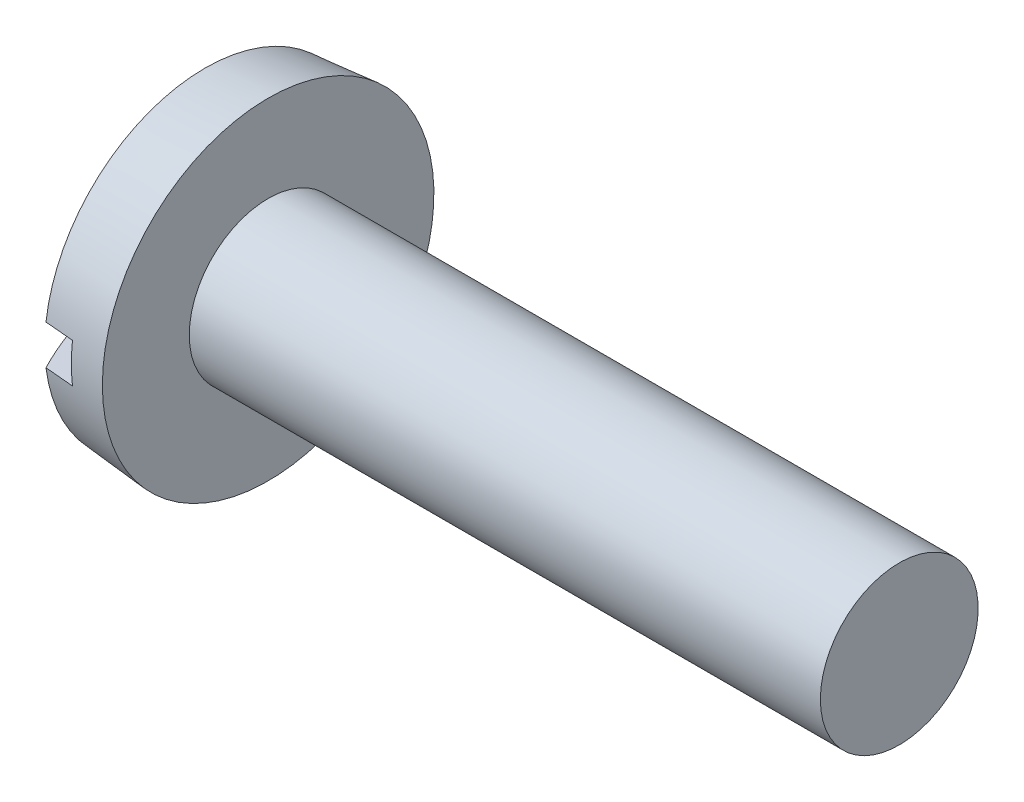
ISO-10303-21;
HEADER;
FILE_DESCRIPTION(('STEP AP214'),'2;1');
FILE_NAME('part.step','',(''),(''),'','','');
FILE_SCHEMA(('AUTOMOTIVE_DESIGN { 1 0 10303 214 1 1 1 1 }'));
ENDSEC;
DATA;
#1=APPLICATION_CONTEXT('core data for automotive mechanical design processes');
#2=APPLICATION_PROTOCOL_DEFINITION('international standard','automotive_design',2000,#1);
#3=PRODUCT_CONTEXT('',#1,'mechanical');
#4=PRODUCT('Part','Part','',(#3));
#5=PRODUCT_RELATED_PRODUCT_CATEGORY('part','',(#4));
#6=PRODUCT_DEFINITION_FORMATION('','',#4);
#7=PRODUCT_DEFINITION_CONTEXT('part definition',#1,'design');
#8=PRODUCT_DEFINITION('design','',#6,#7);
#9=PRODUCT_DEFINITION_SHAPE('','',#8);
#10=(LENGTH_UNIT() NAMED_UNIT(*) SI_UNIT(.MILLI.,.METRE.));
#11=(NAMED_UNIT(*) PLANE_ANGLE_UNIT() SI_UNIT($,.RADIAN.));
#12=(NAMED_UNIT(*) SI_UNIT($,.STERADIAN.) SOLID_ANGLE_UNIT());
#13=UNCERTAINTY_MEASURE_WITH_UNIT(LENGTH_MEASURE(1.E-05),#10,'distance_accuracy_value','');
#14=(GEOMETRIC_REPRESENTATION_CONTEXT(3) GLOBAL_UNCERTAINTY_ASSIGNED_CONTEXT((#13)) GLOBAL_UNIT_ASSIGNED_CONTEXT((#10,
#11,#12)) REPRESENTATION_CONTEXT('',''));
#15=CARTESIAN_POINT('',(0.,0.,0.));
#16=DIRECTION('',(0.,0.,1.));
#17=DIRECTION('',(1.,0.,0.));
#18=AXIS2_PLACEMENT_3D('',#15,#16,#17);
#19=CARTESIAN_POINT('',(4.1402,-1.1938,-10.0076));
#20=DIRECTION('',(1.,0.,0.));
#21=DIRECTION('',(0.,0.,-1.));
#22=AXIS2_PLACEMENT_3D('',#19,#20,#21);
#23=PLANE('',#22);
#24=DIRECTION('',(0.,0.,-1.));
#25=VECTOR('',#24,1.);
#26=CARTESIAN_POINT('',(4.1402,0.735556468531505,-10.0076));
#27=LINE('',#26,#25);
#28=CARTESIAN_POINT('',(4.1402,0.735556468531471,-0.735556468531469));
#29=VERTEX_POINT('',#28);
#30=CARTESIAN_POINT('',(4.1402,0.735556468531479,-2.91484982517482));
#31=VERTEX_POINT('',#30);
#32=EDGE_CURVE('E191',#29,#31,#27,.T.);
#33=ORIENTED_EDGE('',*,*,#32,.F.);
#34=DIRECTION('',(0.,-1.,0.));
#35=VECTOR('',#34,1.);
#36=CARTESIAN_POINT('',(4.1402,-1.1938,-0.735556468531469));
#37=LINE('',#36,#35);
#38=CARTESIAN_POINT('',(4.1402,1.1938,-0.735556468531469));
#39=VERTEX_POINT('',#38);
#40=EDGE_CURVE('E292',#39,#29,#37,.T.);
#41=ORIENTED_EDGE('',*,*,#40,.F.);
#42=DIRECTION('',(0.,0.,1.));
#43=VECTOR('',#42,1.);
#44=CARTESIAN_POINT('',(4.1402,1.1938,-10.0076));
#45=LINE('',#44,#43);
#46=CARTESIAN_POINT('',(4.1402,1.1938,-9.75482339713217));
#47=VERTEX_POINT('',#46);
#48=EDGE_CURVE('E56',#47,#39,#45,.T.);
#49=ORIENTED_EDGE('',*,*,#48,.F.);
#50=CARTESIAN_POINT('',(4.1402,0.,0.));
#51=DIRECTION('',(1.,0.,0.));
#52=DIRECTION('',(0.,0.,-1.));
#53=AXIS2_PLACEMENT_3D('',#50,#51,#52);
#54=CIRCLE('',#53,9.82760082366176);
#55=CARTESIAN_POINT('',(4.1402,-1.1938,-9.75482339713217));
#56=VERTEX_POINT('',#55);
#57=EDGE_CURVE('E245',#56,#47,#54,.T.);
#58=ORIENTED_EDGE('',*,*,#57,.F.);
#59=DIRECTION('',(0.,0.,-1.));
#60=VECTOR('',#59,1.);
#61=CARTESIAN_POINT('',(4.1402,-1.1938,10.0076));
#62=LINE('',#61,#60);
#63=CARTESIAN_POINT('',(4.1402,-1.1938,-0.735556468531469));
#64=VERTEX_POINT('',#63);
#65=EDGE_CURVE('E218',#64,#56,#62,.T.);
#66=ORIENTED_EDGE('',*,*,#65,.F.);
#67=CARTESIAN_POINT('',(4.1402,-0.735556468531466,-0.735556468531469));
#68=VERTEX_POINT('',#67);
#69=EDGE_CURVE('E291',#68,#64,#37,.T.);
#70=ORIENTED_EDGE('',*,*,#69,.F.);
#71=DIRECTION('',(0.,0.,1.));
#72=VECTOR('',#71,1.);
#73=CARTESIAN_POINT('',(4.1402,-0.735556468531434,-10.0076));
#74=LINE('',#73,#72);
#75=CARTESIAN_POINT('',(4.1402,-0.735556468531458,-2.91484982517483));
#76=VERTEX_POINT('',#75);
#77=EDGE_CURVE('E332',#76,#68,#74,.T.);
#78=ORIENTED_EDGE('',*,*,#77,.F.);
#79=DIRECTION('',(0.,1.,0.));
#80=VECTOR('',#79,1.);
#81=CARTESIAN_POINT('',(4.1402,-1.19380000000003,-2.91484982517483));
#82=LINE('',#81,#80);
#83=EDGE_CURVE('E164',#76,#31,#82,.T.);
#84=ORIENTED_EDGE('',*,*,#83,.T.);
#85=EDGE_LOOP('',(#33,#41,#49,#58,#66,#70,#78,#84));
#86=FACE_BOUND('',#85,.T.);
#87=ADVANCED_FACE('F33',(#86),#23,.F.);
#88=DIRECTION('',(0.,0.,-1.));
#89=VECTOR('',#88,1.);
#90=CARTESIAN_POINT('',(4.1402,0.735556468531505,-10.0076));
#91=LINE('',#90,#89);
#92=CARTESIAN_POINT('',(4.1402,0.735556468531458,2.91484982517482));
#93=VERTEX_POINT('',#92);
#94=CARTESIAN_POINT('',(4.1402,0.735556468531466,0.735556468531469));
#95=VERTEX_POINT('',#94);
#96=EDGE_CURVE('E152',#93,#95,#91,.T.);
#97=ORIENTED_EDGE('',*,*,#96,.F.);
#98=DIRECTION('',(0.,-1.,0.));
#99=VECTOR('',#98,1.);
#100=CARTESIAN_POINT('',(4.1402,-1.19380000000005,2.91484982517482));
#101=LINE('',#100,#99);
#102=CARTESIAN_POINT('',(4.1402,-0.735556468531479,2.91484982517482));
#103=VERTEX_POINT('',#102);
#104=EDGE_CURVE('E163',#93,#103,#101,.T.);
#105=ORIENTED_EDGE('',*,*,#104,.T.);
#106=DIRECTION('',(0.,0.,1.));
#107=VECTOR('',#106,1.);
#108=CARTESIAN_POINT('',(4.1402,-0.735556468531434,-10.0076));
#109=LINE('',#108,#107);
#110=CARTESIAN_POINT('',(4.1402,-0.735556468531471,0.735556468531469));
#111=VERTEX_POINT('',#110);
#112=EDGE_CURVE('E340',#111,#103,#109,.T.);
#113=ORIENTED_EDGE('',*,*,#112,.F.);
#114=DIRECTION('',(0.,1.,0.));
#115=VECTOR('',#114,1.);
#116=CARTESIAN_POINT('',(4.1402,-1.1938,0.735556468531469));
#117=LINE('',#116,#115);
#118=CARTESIAN_POINT('',(4.1402,-1.1938,0.735556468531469));
#119=VERTEX_POINT('',#118);
#120=EDGE_CURVE('E289',#119,#111,#117,.T.);
#121=ORIENTED_EDGE('',*,*,#120,.F.);
#122=CARTESIAN_POINT('',(4.1402,-1.1938,9.75482339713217));
#123=VERTEX_POINT('',#122);
#124=EDGE_CURVE('E219',#123,#119,#62,.T.);
#125=ORIENTED_EDGE('',*,*,#124,.F.);
#126=CARTESIAN_POINT('',(4.1402,1.1938,9.75482339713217));
#127=VERTEX_POINT('',#126);
#128=EDGE_CURVE('E249',#127,#123,#54,.T.);
#129=ORIENTED_EDGE('',*,*,#128,.F.);
#130=CARTESIAN_POINT('',(4.1402,1.1938,0.735556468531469));
#131=VERTEX_POINT('',#130);
#132=EDGE_CURVE('E222',#131,#127,#45,.T.);
#133=ORIENTED_EDGE('',*,*,#132,.F.);
#134=EDGE_CURVE('E288',#95,#131,#117,.T.);
#135=ORIENTED_EDGE('',*,*,#134,.F.);
#136=EDGE_LOOP('',(#97,#105,#113,#121,#125,#129,#133,#135));
#137=FACE_BOUND('',#136,.T.);
#138=ADVANCED_FACE('F368',(#137),#23,.F.);
#139=CARTESIAN_POINT('',(7.9338156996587,0.,-0.466952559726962));
#140=DIRECTION('',(-0.0706273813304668,0.,0.997502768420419));
#141=DIRECTION('',(0.99750276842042,0.,0.0706273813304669));
#142=AXIS2_PLACEMENT_3D('',#139,#140,#141);
#143=PLANE('',#142);
#144=ORIENTED_EDGE('',*,*,#40,.T.);
#145=DIRECTION('',(0.995024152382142,-0.0704518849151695,0.0704518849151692));
#146=VECTOR('',#145,1.);
#147=CARTESIAN_POINT('',(7.96654969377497,0.464634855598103,-0.464634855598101));
#148=LINE('',#147,#146);
#149=CARTESIAN_POINT('',(7.2644,0.514350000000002,-0.514349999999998));
#150=VERTEX_POINT('',#149);
#151=EDGE_CURVE('E193',#29,#150,#148,.T.);
#152=ORIENTED_EDGE('',*,*,#151,.T.);
#153=DIRECTION('',(0.791711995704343,-0.608317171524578,0.0560565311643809));
#154=VECTOR('',#153,1.);
#155=CARTESIAN_POINT('',(0.,6.096,-1.0287));
#156=LINE('',#155,#154);
#157=CARTESIAN_POINT('',(0.766265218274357,5.50723502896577,-0.974445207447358));
#158=VERTEX_POINT('',#157);
#159=EDGE_CURVE('E175',#158,#150,#156,.T.);
#160=ORIENTED_EDGE('',*,*,#159,.F.);
#161=CARTESIAN_POINT('',(20.7620372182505,0.,0.44133934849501));
#162=DIRECTION('',(-0.0706273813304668,0.,0.997502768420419));
#163=DIRECTION('',(0.99750276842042,0.,0.0706273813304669));
#164=AXIS2_PLACEMENT_3D('',#161,#162,#163);
#165=CIRCLE('',#164,20.788578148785);
#166=CARTESIAN_POINT('',(0.0595930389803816,1.1938,-1.02448056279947));
#167=VERTEX_POINT('',#166);
#168=EDGE_CURVE('E212',#167,#158,#165,.F.);
#169=ORIENTED_EDGE('',*,*,#168,.F.);
#170=DIRECTION('',(-0.99750276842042,0.,-0.0706273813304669));
#171=VECTOR('',#170,1.);
#172=CARTESIAN_POINT('',(3.48697518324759,1.1938,-0.781807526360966));
#173=LINE('',#172,#171);
#174=EDGE_CURVE('E206',#39,#167,#173,.T.);
#175=ORIENTED_EDGE('',*,*,#174,.F.);
#176=EDGE_LOOP('',(#144,#152,#160,#169,#175));
#177=FACE_BOUND('',#176,.T.);
#178=ADVANCED_FACE('F358',(#177),#143,.T.);
#179=DIRECTION('',(0.791711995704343,0.608317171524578,0.0560565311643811));
#180=VECTOR('',#179,1.);
#181=CARTESIAN_POINT('',(0.,-6.096,-1.0287));
#182=LINE('',#181,#180);
#183=CARTESIAN_POINT('',(0.76626521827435,-5.50723502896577,-0.974445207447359));
#184=VERTEX_POINT('',#183);
#185=CARTESIAN_POINT('',(7.2644,-0.51435,-0.51435));
#186=VERTEX_POINT('',#185);
#187=EDGE_CURVE('E176',#184,#186,#182,.T.);
#188=ORIENTED_EDGE('',*,*,#187,.T.);
#189=DIRECTION('',(-0.995024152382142,-0.0704518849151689,-0.0704518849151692));
#190=VECTOR('',#189,1.);
#191=CARTESIAN_POINT('',(7.96654969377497,-0.464634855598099,-0.464634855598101));
#192=LINE('',#191,#190);
#193=EDGE_CURVE('E337',#186,#68,#192,.T.);
#194=ORIENTED_EDGE('',*,*,#193,.T.);
#195=ORIENTED_EDGE('',*,*,#69,.T.);
#196=DIRECTION('',(0.99750276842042,0.,0.0706273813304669));
#197=VECTOR('',#196,1.);
#198=CARTESIAN_POINT('',(4.89706620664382,-1.1938,-0.68196716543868));
#199=LINE('',#198,#197);
#200=CARTESIAN_POINT('',(0.0595930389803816,-1.1938,-1.02448056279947));
#201=VERTEX_POINT('',#200);
#202=EDGE_CURVE('E209',#201,#64,#199,.T.);
#203=ORIENTED_EDGE('',*,*,#202,.F.);
#204=CARTESIAN_POINT('',(20.7620372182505,0.,0.44133934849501));
#205=DIRECTION('',(-0.0706273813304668,0.,0.997502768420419));
#206=DIRECTION('',(0.99750276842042,0.,0.0706273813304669));
#207=AXIS2_PLACEMENT_3D('',#204,#205,#206);
#208=CIRCLE('',#207,20.788578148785);
#209=EDGE_CURVE('E215',#184,#201,#208,.F.);
#210=ORIENTED_EDGE('',*,*,#209,.F.);
#211=EDGE_LOOP('',(#188,#194,#195,#203,#210));
#212=FACE_BOUND('',#211,.T.);
#213=ADVANCED_FACE('F335',(#212),#143,.T.);
#214=CARTESIAN_POINT('',(7.9338156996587,0.,0.466952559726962));
#215=DIRECTION('',(-0.0706273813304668,0.,-0.997502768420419));
#216=DIRECTION('',(-0.99750276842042,0.,0.0706273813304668));
#217=AXIS2_PLACEMENT_3D('',#214,#215,#216);
#218=PLANE('',#217);
#219=DIRECTION('',(0.791711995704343,-0.608317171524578,-0.0560565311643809));
#220=VECTOR('',#219,1.);
#221=CARTESIAN_POINT('',(0.,6.096,1.0287));
#222=LINE('',#221,#220);
#223=CARTESIAN_POINT('',(0.766265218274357,5.50723502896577,0.974445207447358));
#224=VERTEX_POINT('',#223);
#225=CARTESIAN_POINT('',(7.2644,0.514349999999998,0.514350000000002));
#226=VERTEX_POINT('',#225);
#227=EDGE_CURVE('E168',#224,#226,#222,.T.);
#228=ORIENTED_EDGE('',*,*,#227,.T.);
#229=DIRECTION('',(-0.995024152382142,0.070451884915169,0.0704518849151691));
#230=VECTOR('',#229,1.);
#231=CARTESIAN_POINT('',(7.96654969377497,0.464634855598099,0.464634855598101));
#232=LINE('',#231,#230);
#233=EDGE_CURVE('E11',#226,#95,#232,.T.);
#234=ORIENTED_EDGE('',*,*,#233,.T.);
#235=ORIENTED_EDGE('',*,*,#134,.T.);
#236=DIRECTION('',(0.99750276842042,0.,-0.0706273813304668));
#237=VECTOR('',#236,1.);
#238=CARTESIAN_POINT('',(4.89706620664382,1.1938,0.68196716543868));
#239=LINE('',#238,#237);
#240=CARTESIAN_POINT('',(0.0595930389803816,1.1938,1.02448056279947));
#241=VERTEX_POINT('',#240);
#242=EDGE_CURVE('E198',#241,#131,#239,.T.);
#243=ORIENTED_EDGE('',*,*,#242,.F.);
#244=CARTESIAN_POINT('',(20.7620372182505,0.,-0.441339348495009));
#245=DIRECTION('',(-0.0706273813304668,0.,-0.997502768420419));
#246=DIRECTION('',(-0.99750276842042,0.,0.0706273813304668));
#247=AXIS2_PLACEMENT_3D('',#244,#245,#246);
#248=CIRCLE('',#247,20.788578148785);
#249=EDGE_CURVE('E172',#224,#241,#248,.F.);
#250=ORIENTED_EDGE('',*,*,#249,.F.);
#251=EDGE_LOOP('',(#228,#234,#235,#243,#250));
#252=FACE_BOUND('',#251,.T.);
#253=ADVANCED_FACE('F170',(#252),#218,.T.);
#254=ORIENTED_EDGE('',*,*,#120,.T.);
#255=DIRECTION('',(0.995024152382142,0.0704518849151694,-0.0704518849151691));
#256=VECTOR('',#255,1.);
#257=CARTESIAN_POINT('',(7.96654969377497,-0.464634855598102,0.464634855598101));
#258=LINE('',#257,#256);
#259=CARTESIAN_POINT('',(7.2644,-0.51435,0.51435));
#260=VERTEX_POINT('',#259);
#261=EDGE_CURVE('E307',#111,#260,#258,.T.);
#262=ORIENTED_EDGE('',*,*,#261,.T.);
#263=DIRECTION('',(0.791711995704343,0.608317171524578,-0.0560565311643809));
#264=VECTOR('',#263,1.);
#265=CARTESIAN_POINT('',(0.,-6.096,1.0287));
#266=LINE('',#265,#264);
#267=CARTESIAN_POINT('',(0.76626521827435,-5.50723502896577,0.974445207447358));
#268=VERTEX_POINT('',#267);
#269=EDGE_CURVE('E302',#268,#260,#266,.T.);
#270=ORIENTED_EDGE('',*,*,#269,.F.);
#271=CARTESIAN_POINT('',(20.7620372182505,0.,-0.441339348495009));
#272=DIRECTION('',(-0.0706273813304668,0.,-0.997502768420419));
#273=DIRECTION('',(-0.99750276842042,0.,0.0706273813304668));
#274=AXIS2_PLACEMENT_3D('',#271,#272,#273);
#275=CIRCLE('',#274,20.788578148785);
#276=CARTESIAN_POINT('',(0.0595930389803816,-1.1938,1.02448056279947));
#277=VERTEX_POINT('',#276);
#278=EDGE_CURVE('E203',#277,#268,#275,.F.);
#279=ORIENTED_EDGE('',*,*,#278,.F.);
#280=DIRECTION('',(-0.99750276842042,0.,0.0706273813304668));
#281=VECTOR('',#280,1.);
#282=CARTESIAN_POINT('',(3.48697518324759,-1.1938,0.781807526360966));
#283=LINE('',#282,#281);
#284=EDGE_CURVE('E48',#119,#277,#283,.T.);
#285=ORIENTED_EDGE('',*,*,#284,.F.);
#286=EDGE_LOOP('',(#254,#262,#270,#279,#285));
#287=FACE_BOUND('',#286,.T.);
#288=ADVANCED_FACE('F306',(#287),#218,.T.);
#289=CARTESIAN_POINT('',(20.7932858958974,0.,0.));
#290=DIRECTION('',(-1.,0.,0.));
#291=DIRECTION('',(0.,1.,0.));
#292=AXIS2_PLACEMENT_3D('',#289,#290,#291);
#293=SPHERICAL_SURFACE('',#292,20.7932858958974);
#294=CARTESIAN_POINT('',(16.0196413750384,6.21279787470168,0.));
#295=DIRECTION('',(0.609275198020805,-0.79295884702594,0.));
#296=DIRECTION('',(0.79295884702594,0.609275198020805,0.));
#297=AXIS2_PLACEMENT_3D('',#294,#295,#296);
#298=CIRCLE('',#297,19.2606905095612);
#299=EDGE_CURVE('E41',#184,#268,#298,.F.);
#300=ORIENTED_EDGE('',*,*,#299,.F.);
#301=ORIENTED_EDGE('',*,*,#209,.T.);
#302=CARTESIAN_POINT('',(20.7932858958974,-1.1938,0.));
#303=DIRECTION('',(0.,1.,0.));
#304=DIRECTION('',(0.,0.,1.));
#305=AXIS2_PLACEMENT_3D('',#302,#303,#304);
#306=CIRCLE('',#305,20.758987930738);
#307=CARTESIAN_POINT('',(2.3876,-1.1938,-9.6003284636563));
#308=VERTEX_POINT('',#307);
#309=EDGE_CURVE('E228',#201,#308,#306,.F.);
#310=ORIENTED_EDGE('',*,*,#309,.T.);
#311=CARTESIAN_POINT('',(2.3876,0.,0.));
#312=DIRECTION('',(-1.,0.,0.));
#313=DIRECTION('',(0.,0.,1.));
#314=AXIS2_PLACEMENT_3D('',#311,#312,#313);
#315=CIRCLE('',#314,9.67426819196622);
#316=CARTESIAN_POINT('',(2.3876,-1.1938,9.60032846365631));
#317=VERTEX_POINT('',#316);
#318=EDGE_CURVE('E238',#308,#317,#315,.T.);
#319=ORIENTED_EDGE('',*,*,#318,.T.);
#320=EDGE_CURVE('E229',#317,#277,#306,.F.);
#321=ORIENTED_EDGE('',*,*,#320,.T.);
#322=ORIENTED_EDGE('',*,*,#278,.T.);
#323=EDGE_LOOP('',(#300,#301,#310,#319,#321,#322));
#324=FACE_BOUND('',#323,.T.);
#325=ADVANCED_FACE('F309',(#324),#293,.T.);
#326=CARTESIAN_POINT('',(20.7932858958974,1.1938,0.));
#327=DIRECTION('',(0.,-1.,0.));
#328=DIRECTION('',(0.,0.,-1.));
#329=AXIS2_PLACEMENT_3D('',#326,#327,#328);
#330=CIRCLE('',#329,20.758987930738);
#331=CARTESIAN_POINT('',(2.3876,1.1938,-9.6003284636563));
#332=VERTEX_POINT('',#331);
#333=EDGE_CURVE('E225',#332,#167,#330,.F.);
#334=ORIENTED_EDGE('',*,*,#333,.T.);
#335=ORIENTED_EDGE('',*,*,#168,.T.);
#336=CARTESIAN_POINT('',(16.0196413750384,-6.21279787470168,0.));
#337=DIRECTION('',(0.609275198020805,0.79295884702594,0.));
#338=DIRECTION('',(-0.79295884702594,0.609275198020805,0.));
#339=AXIS2_PLACEMENT_3D('',#336,#337,#338);
#340=CIRCLE('',#339,19.2606905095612);
#341=EDGE_CURVE('E295',#224,#158,#340,.F.);
#342=ORIENTED_EDGE('',*,*,#341,.F.);
#343=ORIENTED_EDGE('',*,*,#249,.T.);
#344=CARTESIAN_POINT('',(2.3876,1.1938,9.60032846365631));
#345=VERTEX_POINT('',#344);
#346=EDGE_CURVE('E224',#241,#345,#330,.F.);
#347=ORIENTED_EDGE('',*,*,#346,.T.);
#348=EDGE_CURVE('E239',#345,#332,#315,.T.);
#349=ORIENTED_EDGE('',*,*,#348,.T.);
#350=EDGE_LOOP('',(#334,#335,#342,#343,#347,#349));
#351=FACE_BOUND('',#350,.T.);
#352=ADVANCED_FACE('F372',(#351),#293,.T.);
#353=CARTESIAN_POINT('',(4.1402,-1.1938,10.0076));
#354=DIRECTION('',(0.,1.,0.));
#355=DIRECTION('',(0.,0.,1.));
#356=AXIS2_PLACEMENT_3D('',#353,#354,#355);
#357=PLANE('',#356);
#358=ORIENTED_EDGE('',*,*,#309,.F.);
#359=ORIENTED_EDGE('',*,*,#202,.T.);
#360=ORIENTED_EDGE('',*,*,#65,.T.);
#361=CARTESIAN_POINT('',(20.9117012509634,-1.1938,-11.2316513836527));
#362=CARTESIAN_POINT('',(17.938567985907,-1.1938,-10.9700682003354));
#363=CARTESIAN_POINT('',(14.9654431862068,-1.1938,-10.7083887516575));
#364=CARTESIAN_POINT('',(9.01921592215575,-1.1938,-10.184776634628));
#365=CARTESIAN_POINT('',(6.04611345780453,-1.1938,-9.92284396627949));
#366=CARTESIAN_POINT('',(0.0999361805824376,-1.1938,-9.3986647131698));
#367=CARTESIAN_POINT('',(-2.87313863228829,-1.1938,-9.1364181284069));
#368=CARTESIAN_POINT('',(-8.81925174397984,-1.1938,-8.61151093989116));
#369=CARTESIAN_POINT('',(-11.7922900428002,-1.1938,-8.34885033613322));
#370=CARTESIAN_POINT('',(-14.7653056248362,-1.1938,-8.08593267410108));
#371=B_SPLINE_CURVE_WITH_KNOTS('',3,(#361,#362,#363,#364,#365,#366,#367,#368,#369,#370),
.UNSPECIFIED.,.F.,.F.,(4,2,2,2,4),(0.,8.95385529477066,17.9077104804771,26.8615657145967,
35.815421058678),.UNSPECIFIED.);
#372=EDGE_CURVE('E256',#56,#308,#371,.T.);
#373=ORIENTED_EDGE('',*,*,#372,.T.);
#374=EDGE_LOOP('',(#358,#359,#360,#373));
#375=FACE_BOUND('',#374,.T.);
#376=ADVANCED_FACE('F274',(#375),#357,.T.);
#377=ORIENTED_EDGE('',*,*,#124,.T.);
#378=ORIENTED_EDGE('',*,*,#284,.T.);
#379=ORIENTED_EDGE('',*,*,#320,.F.);
#380=CARTESIAN_POINT('',(-14.7653056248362,-1.1938,8.08593267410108));
#381=CARTESIAN_POINT('',(-9.7725766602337,-1.1938,8.52744442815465));
#382=CARTESIAN_POINT('',(-4.77978655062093,-1.1938,8.96826372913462));
#383=CARTESIAN_POINT('',(1.16637171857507,-1.1938,9.49265901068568));
#384=CARTESIAN_POINT('',(2.11969753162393,-1.1938,9.57671508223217));
#385=CARTESIAN_POINT('',(9.01920230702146,-1.1938,10.184931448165));
#386=CARTESIAN_POINT('',(14.9654374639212,-1.1938,10.7084544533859));
#387=CARTESIAN_POINT('',(20.9117012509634,-1.1938,11.2316513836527));
#388=B_SPLINE_CURVE_WITH_KNOTS('',3,(#380,#381,#382,#383,#384,#385,#386,#387),.UNSPECIFIED.,.F.,
.F.,(4,2,2,4),(0.,15.036637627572,17.9077105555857,35.8154210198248),.UNSPECIFIED.);
#389=EDGE_CURVE('E283',#317,#123,#388,.T.);
#390=ORIENTED_EDGE('',*,*,#389,.T.);
#391=EDGE_LOOP('',(#377,#378,#379,#390));
#392=FACE_BOUND('',#391,.T.);
#393=ADVANCED_FACE('F271',(#392),#357,.T.);
#394=CARTESIAN_POINT('',(4.1402,1.1938,-10.0076));
#395=DIRECTION('',(0.,-1.,0.));
#396=DIRECTION('',(0.,0.,-1.));
#397=AXIS2_PLACEMENT_3D('',#394,#395,#396);
#398=PLANE('',#397);
#399=ORIENTED_EDGE('',*,*,#48,.T.);
#400=ORIENTED_EDGE('',*,*,#174,.T.);
#401=ORIENTED_EDGE('',*,*,#333,.F.);
#402=CARTESIAN_POINT('',(-14.7653056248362,1.1938,-8.08593267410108));
#403=CARTESIAN_POINT('',(-9.77257666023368,1.1938,-8.52744442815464));
#404=CARTESIAN_POINT('',(-4.77978655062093,1.1938,-8.96826372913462));
#405=CARTESIAN_POINT('',(1.16637171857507,1.1938,-9.49265901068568));
#406=CARTESIAN_POINT('',(2.11969753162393,1.1938,-9.57671508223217));
#407=CARTESIAN_POINT('',(9.01920230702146,1.1938,-10.184931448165));
#408=CARTESIAN_POINT('',(14.9654374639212,1.1938,-10.7084544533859));
#409=CARTESIAN_POINT('',(20.9117012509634,1.1938,-11.2316513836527));
#410=B_SPLINE_CURVE_WITH_KNOTS('',3,(#402,#403,#404,#405,#406,#407,#408,#409),.UNSPECIFIED.,.F.,
.F.,(4,2,2,4),(0.,15.036637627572,17.9077105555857,35.8154210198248),.UNSPECIFIED.);
#411=EDGE_CURVE('E248',#332,#47,#410,.T.);
#412=ORIENTED_EDGE('',*,*,#411,.T.);
#413=EDGE_LOOP('',(#399,#400,#401,#412));
#414=FACE_BOUND('',#413,.T.);
#415=ADVANCED_FACE('F266',(#414),#398,.T.);
#416=ORIENTED_EDGE('',*,*,#346,.F.);
#417=ORIENTED_EDGE('',*,*,#242,.T.);
#418=ORIENTED_EDGE('',*,*,#132,.T.);
#419=CARTESIAN_POINT('',(20.9117012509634,1.1938,11.2316513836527));
#420=CARTESIAN_POINT('',(17.938567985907,1.1938,10.9700682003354));
#421=CARTESIAN_POINT('',(14.9654431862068,1.1938,10.7083887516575));
#422=CARTESIAN_POINT('',(9.01921592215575,1.1938,10.184776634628));
#423=CARTESIAN_POINT('',(6.04611345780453,1.1938,9.92284396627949));
#424=CARTESIAN_POINT('',(0.0999361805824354,1.1938,9.3986647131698));
#425=CARTESIAN_POINT('',(-2.87313863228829,1.1938,9.1364181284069));
#426=CARTESIAN_POINT('',(-8.81925174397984,1.1938,8.61151093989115));
#427=CARTESIAN_POINT('',(-11.7922900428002,1.1938,8.34885033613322));
#428=CARTESIAN_POINT('',(-14.7653056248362,1.1938,8.08593267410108));
#429=B_SPLINE_CURVE_WITH_KNOTS('',3,(#419,#420,#421,#422,#423,#424,#425,#426,#427,#428),
.UNSPECIFIED.,.F.,.F.,(4,2,2,2,4),(0.,8.95385529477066,17.9077104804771,26.8615657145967,
35.815421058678),.UNSPECIFIED.);
#430=EDGE_CURVE('E277',#127,#345,#429,.T.);
#431=ORIENTED_EDGE('',*,*,#430,.T.);
#432=EDGE_LOOP('',(#416,#417,#418,#431));
#433=FACE_BOUND('',#432,.T.);
#434=ADVANCED_FACE('F270',(#433),#398,.T.);
#435=CARTESIAN_POINT('',(6.1976,0.,0.));
#436=DIRECTION('',(1.,0.,0.));
#437=DIRECTION('',(0.,0.,-1.));
#438=AXIS2_PLACEMENT_3D('',#435,#436,#437);
#439=CONICAL_SURFACE('',#438,10.0076,0.0872664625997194);
#440=CARTESIAN_POINT('',(6.1976,0.,0.));
#441=DIRECTION('',(-1.,0.,0.));
#442=DIRECTION('',(0.,0.,1.));
#443=AXIS2_PLACEMENT_3D('',#440,#441,#442);
#444=CIRCLE('',#443,10.0076);
#445=CARTESIAN_POINT('',(6.1976,0.,10.0076));
#446=VERTEX_POINT('',#445);
#447=EDGE_CURVE('E235',#446,#446,#444,.T.);
#448=ORIENTED_EDGE('',*,*,#447,.T.);
#449=EDGE_LOOP('',(#448));
#450=FACE_BOUND('',#449,.T.);
#451=ORIENTED_EDGE('',*,*,#389,.F.);
#452=ORIENTED_EDGE('',*,*,#318,.F.);
#453=ORIENTED_EDGE('',*,*,#372,.F.);
#454=ORIENTED_EDGE('',*,*,#57,.T.);
#455=ORIENTED_EDGE('',*,*,#411,.F.);
#456=ORIENTED_EDGE('',*,*,#348,.F.);
#457=ORIENTED_EDGE('',*,*,#430,.F.);
#458=ORIENTED_EDGE('',*,*,#128,.T.);
#459=EDGE_LOOP('',(#451,#452,#453,#454,#455,#456,#457,#458));
#460=FACE_BOUND('',#459,.T.);
#461=ADVANCED_FACE('F262',(#450,#460),#439,.T.);
#462=CARTESIAN_POINT('',(-25.4,0.,0.));
#463=DIRECTION('',(-1.,0.,0.));
#464=DIRECTION('',(0.,0.,1.));
#465=AXIS2_PLACEMENT_3D('',#462,#463,#464);
#466=CYLINDRICAL_SURFACE('',#465,4.7625);
#467=CARTESIAN_POINT('',(44.2976,0.,0.));
#468=DIRECTION('',(-1.,0.,0.));
#469=DIRECTION('',(0.,0.,1.));
#470=AXIS2_PLACEMENT_3D('',#467,#468,#469);
#471=CIRCLE('',#470,4.7625);
#472=CARTESIAN_POINT('',(44.2976,0.,4.7625));
#473=VERTEX_POINT('',#472);
#474=EDGE_CURVE('E242',#473,#473,#471,.T.);
#475=ORIENTED_EDGE('',*,*,#474,.T.);
#476=EDGE_LOOP('',(#475));
#477=FACE_BOUND('',#476,.T.);
#478=CARTESIAN_POINT('',(6.1976,0.,0.));
#479=DIRECTION('',(-1.,0.,0.));
#480=DIRECTION('',(0.,0.,1.));
#481=AXIS2_PLACEMENT_3D('',#478,#479,#480);
#482=CIRCLE('',#481,4.7625);
#483=CARTESIAN_POINT('',(6.1976,0.,4.7625));
#484=VERTEX_POINT('',#483);
#485=EDGE_CURVE('E232',#484,#484,#482,.T.);
#486=ORIENTED_EDGE('',*,*,#485,.F.);
#487=EDGE_LOOP('',(#486));
#488=FACE_BOUND('',#487,.T.);
#489=ADVANCED_FACE('F35',(#477,#488),#466,.T.);
#490=CARTESIAN_POINT('',(44.2976,4.7625,0.));
#491=DIRECTION('',(1.,0.,0.));
#492=DIRECTION('',(0.,0.,-1.));
#493=AXIS2_PLACEMENT_3D('',#490,#491,#492);
#494=PLANE('',#493);
#495=ORIENTED_EDGE('',*,*,#474,.F.);
#496=EDGE_LOOP('',(#495));
#497=FACE_BOUND('',#496,.T.);
#498=ADVANCED_FACE('F401',(#497),#494,.T.);
#499=CARTESIAN_POINT('',(6.1976,4.7625,0.));
#500=DIRECTION('',(-1.,0.,0.));
#501=DIRECTION('',(0.,0.,1.));
#502=AXIS2_PLACEMENT_3D('',#499,#500,#501);
#503=PLANE('',#502);
#504=ORIENTED_EDGE('',*,*,#447,.F.);
#505=EDGE_LOOP('',(#504));
#506=FACE_BOUND('',#505,.T.);
#507=ORIENTED_EDGE('',*,*,#485,.T.);
#508=EDGE_LOOP('',(#507));
#509=FACE_BOUND('',#508,.T.);
#510=ADVANCED_FACE('F396',(#506,#509),#503,.F.);
#511=CARTESIAN_POINT('',(7.2644,0.51435,0.51435));
#512=DIRECTION('',(-1.,0.,0.));
#513=DIRECTION('',(0.,0.,1.));
#514=AXIS2_PLACEMENT_3D('',#511,#512,#513);
#515=PLANE('',#514);
#516=DIRECTION('',(0.,1.,0.));
#517=VECTOR('',#516,1.);
#518=CARTESIAN_POINT('',(7.2644,-0.51435,0.51435));
#519=LINE('',#518,#517);
#520=EDGE_CURVE('E160',#260,#226,#519,.T.);
#521=ORIENTED_EDGE('',*,*,#520,.T.);
#522=DIRECTION('',(0.,0.,-1.));
#523=VECTOR('',#522,1.);
#524=CARTESIAN_POINT('',(7.2644,0.51435,0.51435));
#525=LINE('',#524,#523);
#526=EDGE_CURVE('E180',#226,#150,#525,.T.);
#527=ORIENTED_EDGE('',*,*,#526,.T.);
#528=DIRECTION('',(0.,-1.,0.));
#529=VECTOR('',#528,1.);
#530=CARTESIAN_POINT('',(7.2644,0.51435,-0.51435));
#531=LINE('',#530,#529);
#532=EDGE_CURVE('E185',#150,#186,#531,.T.);
#533=ORIENTED_EDGE('',*,*,#532,.T.);
#534=DIRECTION('',(0.,0.,1.));
#535=VECTOR('',#534,1.);
#536=CARTESIAN_POINT('',(7.2644,-0.51435,-0.51435));
#537=LINE('',#536,#535);
#538=EDGE_CURVE('E190',#186,#260,#537,.T.);
#539=ORIENTED_EDGE('',*,*,#538,.T.);
#540=EDGE_LOOP('',(#521,#527,#533,#539));
#541=FACE_BOUND('',#540,.T.);
#542=ADVANCED_FACE('F188',(#541),#515,.T.);
#543=CARTESIAN_POINT('',(7.2644,0.51435,0.51435));
#544=DIRECTION('',(0.609275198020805,0.79295884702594,0.));
#545=DIRECTION('',(-0.79295884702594,0.609275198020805,0.));
#546=AXIS2_PLACEMENT_3D('',#543,#544,#545);
#547=PLANE('',#546);
#548=ORIENTED_EDGE('',*,*,#341,.T.);
#549=ORIENTED_EDGE('',*,*,#159,.T.);
#550=ORIENTED_EDGE('',*,*,#526,.F.);
#551=ORIENTED_EDGE('',*,*,#227,.F.);
#552=EDGE_LOOP('',(#548,#549,#550,#551));
#553=FACE_BOUND('',#552,.T.);
#554=ADVANCED_FACE('F181',(#553),#547,.F.);
#555=CARTESIAN_POINT('',(7.2644,-0.51435,-0.51435));
#556=DIRECTION('',(0.609275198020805,-0.79295884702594,0.));
#557=DIRECTION('',(0.79295884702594,0.609275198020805,0.));
#558=AXIS2_PLACEMENT_3D('',#555,#556,#557);
#559=PLANE('',#558);
#560=ORIENTED_EDGE('',*,*,#299,.T.);
#561=ORIENTED_EDGE('',*,*,#269,.T.);
#562=ORIENTED_EDGE('',*,*,#538,.F.);
#563=ORIENTED_EDGE('',*,*,#187,.F.);
#564=EDGE_LOOP('',(#560,#561,#562,#563));
#565=FACE_BOUND('',#564,.T.);
#566=ADVANCED_FACE('F301',(#565),#559,.F.);
#567=CARTESIAN_POINT('',(7.9338156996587,-0.466952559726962,0.));
#568=DIRECTION('',(-0.0706273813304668,0.997502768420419,0.));
#569=DIRECTION('',(-0.99750276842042,-0.0706273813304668,0.));
#570=AXIS2_PLACEMENT_3D('',#567,#568,#569);
#571=PLANE('',#570);
#572=ORIENTED_EDGE('',*,*,#112,.T.);
#573=DIRECTION('',(0.791711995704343,0.0560565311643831,-0.608317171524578));
#574=VECTOR('',#573,1.);
#575=CARTESIAN_POINT('',(0.,-1.02870000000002,6.096));
#576=LINE('',#575,#574);
#577=EDGE_CURVE('E165',#103,#260,#576,.T.);
#578=ORIENTED_EDGE('',*,*,#577,.T.);
#579=ORIENTED_EDGE('',*,*,#261,.F.);
#580=EDGE_LOOP('',(#572,#578,#579));
#581=FACE_BOUND('',#580,.T.);
#582=ADVANCED_FACE('F366',(#581),#571,.T.);
#583=CARTESIAN_POINT('',(7.9338156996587,0.466952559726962,0.));
#584=DIRECTION('',(-0.0706273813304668,-0.997502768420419,0.));
#585=DIRECTION('',(0.99750276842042,-0.0706273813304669,0.));
#586=AXIS2_PLACEMENT_3D('',#583,#584,#585);
#587=PLANE('',#586);
#588=ORIENTED_EDGE('',*,*,#96,.T.);
#589=ORIENTED_EDGE('',*,*,#233,.F.);
#590=DIRECTION('',(0.791711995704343,-0.0560565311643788,-0.608317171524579));
#591=VECTOR('',#590,1.);
#592=CARTESIAN_POINT('',(0.,1.02869999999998,6.096));
#593=LINE('',#592,#591);
#594=EDGE_CURVE('E150',#93,#226,#593,.T.);
#595=ORIENTED_EDGE('',*,*,#594,.F.);
#596=EDGE_LOOP('',(#588,#589,#595));
#597=FACE_BOUND('',#596,.T.);
#598=ADVANCED_FACE('F149',(#597),#587,.T.);
#599=CARTESIAN_POINT('',(7.2644,-0.514350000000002,0.514349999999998));
#600=DIRECTION('',(0.609275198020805,0.,0.79295884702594));
#601=DIRECTION('',(-0.79295884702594,0.,0.609275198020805));
#602=AXIS2_PLACEMENT_3D('',#599,#600,#601);
#603=PLANE('',#602);
#604=ORIENTED_EDGE('',*,*,#594,.T.);
#605=ORIENTED_EDGE('',*,*,#520,.F.);
#606=ORIENTED_EDGE('',*,*,#577,.F.);
#607=ORIENTED_EDGE('',*,*,#104,.F.);
#608=EDGE_LOOP('',(#604,#605,#606,#607));
#609=FACE_BOUND('',#608,.T.);
#610=ADVANCED_FACE('F157',(#609),#603,.F.);
#611=ORIENTED_EDGE('',*,*,#32,.T.);
#612=DIRECTION('',(0.791711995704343,-0.0560565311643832,0.608317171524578));
#613=VECTOR('',#612,1.);
#614=CARTESIAN_POINT('',(0.,1.02870000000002,-6.096));
#615=LINE('',#614,#613);
#616=EDGE_CURVE('E355',#31,#150,#615,.T.);
#617=ORIENTED_EDGE('',*,*,#616,.T.);
#618=ORIENTED_EDGE('',*,*,#151,.F.);
#619=EDGE_LOOP('',(#611,#617,#618));
#620=FACE_BOUND('',#619,.T.);
#621=ADVANCED_FACE('F360',(#620),#587,.T.);
#622=ORIENTED_EDGE('',*,*,#77,.T.);
#623=ORIENTED_EDGE('',*,*,#193,.F.);
#624=DIRECTION('',(0.791711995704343,0.0560565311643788,0.608317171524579));
#625=VECTOR('',#624,1.);
#626=CARTESIAN_POINT('',(0.,-1.02869999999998,-6.096));
#627=LINE('',#626,#625);
#628=EDGE_CURVE('E356',#76,#186,#627,.T.);
#629=ORIENTED_EDGE('',*,*,#628,.F.);
#630=EDGE_LOOP('',(#622,#623,#629));
#631=FACE_BOUND('',#630,.T.);
#632=ADVANCED_FACE('F509',(#631),#571,.T.);
#633=CARTESIAN_POINT('',(7.2644,0.514350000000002,-0.514349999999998));
#634=DIRECTION('',(0.609275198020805,0.,-0.79295884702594));
#635=DIRECTION('',(0.79295884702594,0.,0.609275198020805));
#636=AXIS2_PLACEMENT_3D('',#633,#634,#635);
#637=PLANE('',#636);
#638=ORIENTED_EDGE('',*,*,#628,.T.);
#639=ORIENTED_EDGE('',*,*,#532,.F.);
#640=ORIENTED_EDGE('',*,*,#616,.F.);
#641=ORIENTED_EDGE('',*,*,#83,.F.);
#642=EDGE_LOOP('',(#638,#639,#640,#641));
#643=FACE_BOUND('',#642,.T.);
#644=ADVANCED_FACE('F354',(#643),#637,.F.);
#645=CLOSED_SHELL('',(#87,#138,#178,#213,#253,#288,#325,#352,#376,#393,#415,#434,#461,#489,#498,
#510,#542,#554,#566,#582,#598,#610,#621,#632,#644));
#646=MANIFOLD_SOLID_BREP('B2',#645);
#647=ADVANCED_BREP_SHAPE_REPRESENTATION('',(#18,#646),#14);
#648=SHAPE_DEFINITION_REPRESENTATION(#9,#647);
ENDSEC;
END-ISO-10303-21;
